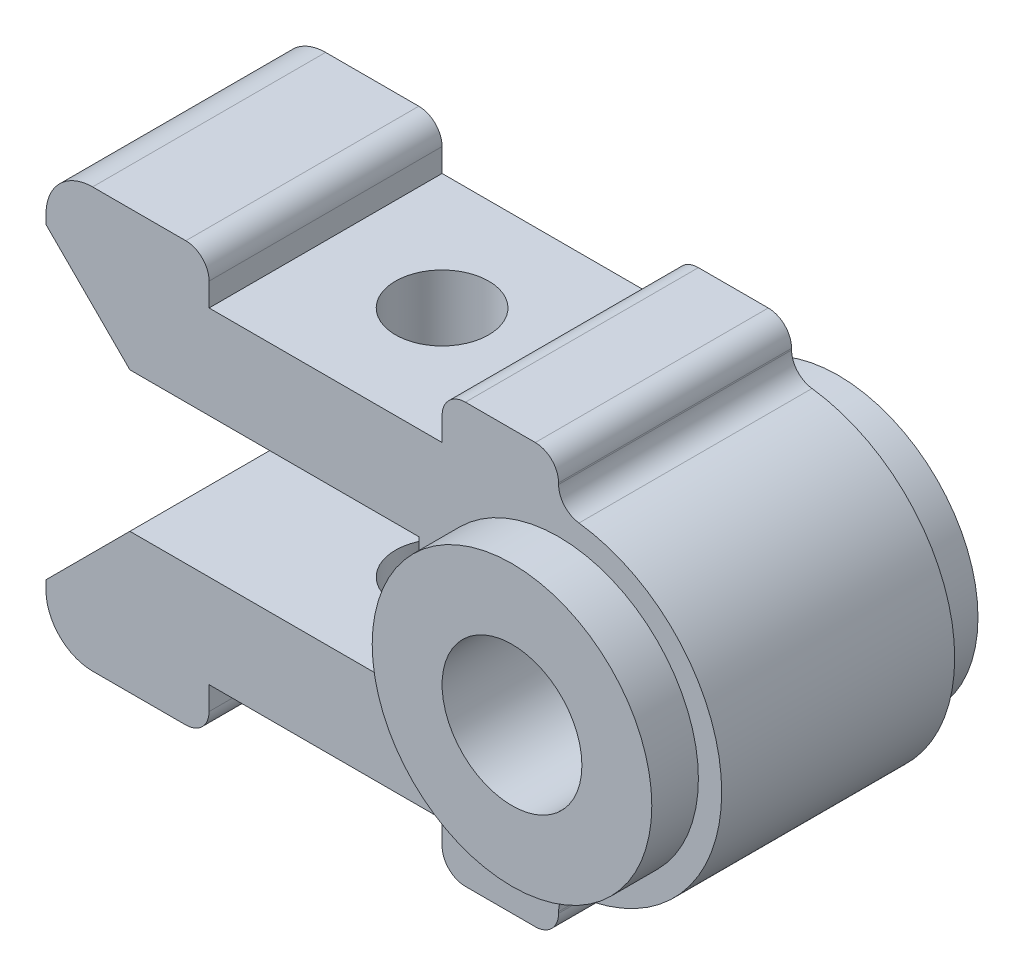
from build123d import *
from build123d.topology import SkipClean

# Parameters (mm, degrees)
EXTRUDE_1_DEPTH          = 2.5
FILLET_1_R               = 1
SKETCH_2_W               = 5
SKETCH_2_H               = 1
CUT_EXTRUDE_1_DEPTH      = 5
CUT_EXTRUDE_2_DEPTH      = 13.298373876
CUT_EXTRUDE_2_DEPTH_BACK = 13.298373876
SKETCH_4_R               = 1
FILLET_2_R               = 0.5
SKETCH_5_R               = 3
SKETCH_5_R_2             = 1.5
EXTRUDE_2_DEPTH          = 1


with BuildPart() as part:
    # Sketch 1 → Extrude 1 (new, symmetric)
    with BuildSketch(Plane.XY):
        Polygon((-5.5, 4.5), (-5.5, 3.3), (-3.7, 1.5), (2.5, 1.5), (5.5, 1.5), (5.5, 3.5), (5.5, 4.5), align=None)
        Polygon((-3.7, -1.5), (-5.5, -3.3), (-5.5, -4.5), (5.5, -4.5), (5.5, -3.5), (5.5, -1.5), (2.5, -1.5), align=None)
        with BuildLine():
            Line((5.5, 3.5), (5.5, 1.5))
            ThreePointArc((5.5, 1.5), (6.560660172, 1.060660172), (7, 0))
            ThreePointArc((7, 0), (6.560660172, -1.060660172), (5.5, -1.5))
            Line((5.5, -1.5), (5.5, -3.5))
            ThreePointArc((5.5, -3.5), (9, 0), (5.5, 3.5))
        make_face()
        with BuildLine():
            Line((5.5, 1.5), (2.5, 1.5))
            Line((2.5, 1.5), (2.5, -1.5))
            Line((2.5, -1.5), (5.5, -1.5))
            ThreePointArc((5.5, -1.5), (4, 0), (5.5, 1.5))
        make_face()
    extrude(amount=EXTRUDE_1_DEPTH, both=True)

    # Fillet 1
    fillet_1_edges = [part.edges().sort_by_distance(p)[0] for p in [
        (-5.5, 4.5, 0),
        (-5.5, -4.5, 0),
    ]]
    fillet(fillet_1_edges, radius=FILLET_1_R)

    # Sketch 2 → Cut-Extrude 1 (cut)
    with BuildSketch(Plane.XY.offset(2.5)):
        with Locations((0.5, 4)):
            Rectangle(SKETCH_2_W, SKETCH_2_H)
        with Locations((0.5, -4)):
            Rectangle(SKETCH_2_W, SKETCH_2_H)
    extrude(amount=-CUT_EXTRUDE_1_DEPTH, mode=Mode.SUBTRACT)

    # Sketch 4 → Cut-Extrude 2 (cut, two sides: drawn at the far end of the back side and taken through both)
    with BuildSketch(Plane.XZ.offset(3.5).offset(-CUT_EXTRUDE_2_DEPTH_BACK)):
        with Locations(Location((0.5, 0, 0), (0, 0, 270))):
            Circle(SKETCH_4_R)
    extrude(amount=CUT_EXTRUDE_2_DEPTH + CUT_EXTRUDE_2_DEPTH_BACK, mode=Mode.SUBTRACT)

    # Fillet 2
    fillet_2_edges = [part.edges().sort_by_distance(p)[0] for p in [
        (5.5, 4.5, 0),
        (5.5, 3.5, 0),
        (5.5, -3.5, 0),
        (5.5, -4.5, 0),
        (-2, 4.5, 0),
        (3, 4.5, 0),
        (-2, -4.5, 0),
        (3, -4.5, 0),
    ]]
    fillet(fillet_2_edges, radius=FILLET_2_R)

    # Sketch 5 → Extrude 2 (add)
    with SkipClean():  # the faces are left unmerged after this step: merging them gives an invalid solid
        with BuildSketch(Plane.XY.offset(2.5)):
            with Locations(Location((5.5, 0, 0), (0, 0, 180))):
                Circle(SKETCH_5_R)
            with Locations((5.5, 0)):
                Circle(SKETCH_5_R_2, mode=Mode.SUBTRACT)
        extrude_2 = extrude(amount=EXTRUDE_2_DEPTH)

    # Mirror 1: Extrude 2 across plane
    add(extrude_2.mirror(Plane.XY))


solid = part.part
